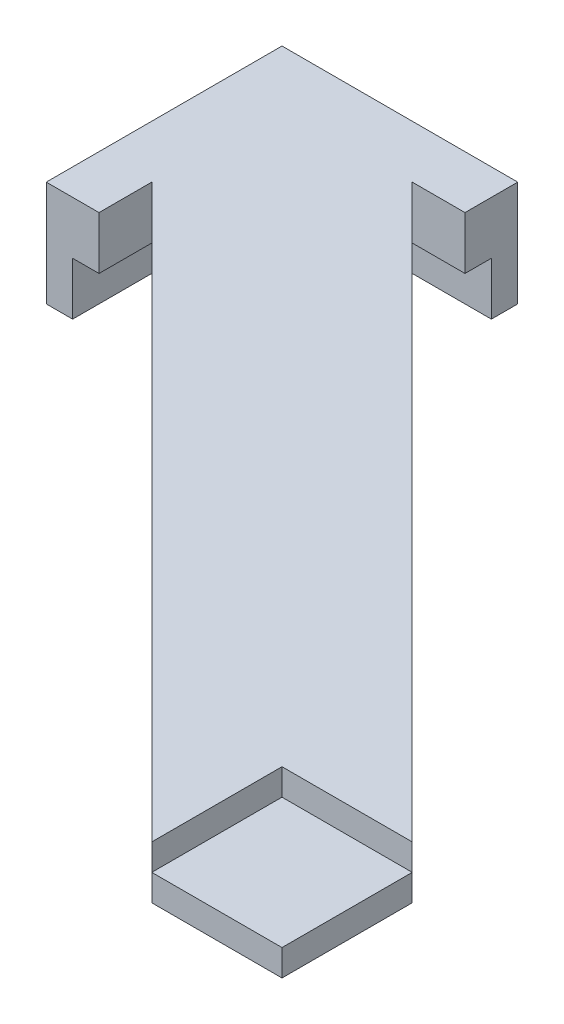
ISO-10303-21;
HEADER;
FILE_DESCRIPTION(('STEP AP214'),'2;1');
FILE_NAME('part.step','',(''),(''),'','','');
FILE_SCHEMA(('AUTOMOTIVE_DESIGN { 1 0 10303 214 1 1 1 1 }'));
ENDSEC;
DATA;
#1=APPLICATION_CONTEXT('core data for automotive mechanical design processes');
#2=APPLICATION_PROTOCOL_DEFINITION('international standard','automotive_design',2000,#1);
#3=PRODUCT_CONTEXT('',#1,'mechanical');
#4=PRODUCT('Part','Part','',(#3));
#5=PRODUCT_RELATED_PRODUCT_CATEGORY('part','',(#4));
#6=PRODUCT_DEFINITION_FORMATION('','',#4);
#7=PRODUCT_DEFINITION_CONTEXT('part definition',#1,'design');
#8=PRODUCT_DEFINITION('design','',#6,#7);
#9=PRODUCT_DEFINITION_SHAPE('','',#8);
#10=(LENGTH_UNIT() NAMED_UNIT(*) SI_UNIT(.MILLI.,.METRE.));
#11=(NAMED_UNIT(*) PLANE_ANGLE_UNIT() SI_UNIT($,.RADIAN.));
#12=(NAMED_UNIT(*) SI_UNIT($,.STERADIAN.) SOLID_ANGLE_UNIT());
#13=UNCERTAINTY_MEASURE_WITH_UNIT(LENGTH_MEASURE(1.E-05),#10,'distance_accuracy_value','');
#14=(GEOMETRIC_REPRESENTATION_CONTEXT(3) GLOBAL_UNCERTAINTY_ASSIGNED_CONTEXT((#13)) GLOBAL_UNIT_ASSIGNED_CONTEXT((#10,
#11,#12)) REPRESENTATION_CONTEXT('',''));
#15=CARTESIAN_POINT('',(0.,0.,0.));
#16=DIRECTION('',(0.,0.,1.));
#17=DIRECTION('',(1.,0.,0.));
#18=AXIS2_PLACEMENT_3D('',#15,#16,#17);
#19=CARTESIAN_POINT('',(0.,0.,0.));
#20=DIRECTION('',(0.,1.,0.));
#21=DIRECTION('',(0.,0.,1.));
#22=AXIS2_PLACEMENT_3D('',#19,#20,#21);
#23=PLANE('',#22);
#24=DIRECTION('',(0.,0.,1.));
#25=VECTOR('',#24,1.);
#26=CARTESIAN_POINT('',(0.,0.,-49.1568651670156));
#27=LINE('',#26,#25);
#28=CARTESIAN_POINT('',(0.,0.,-69.));
#29=VERTEX_POINT('',#28);
#30=CARTESIAN_POINT('',(0.,0.,-49.1568651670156));
#31=VERTEX_POINT('',#30);
#32=EDGE_CURVE('E182',#29,#31,#27,.T.);
#33=ORIENTED_EDGE('',*,*,#32,.F.);
#34=DIRECTION('',(-1.,0.,0.));
#35=VECTOR('',#34,1.);
#36=CARTESIAN_POINT('',(19.8431348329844,0.,-69.));
#37=LINE('',#36,#35);
#38=CARTESIAN_POINT('',(19.8431348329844,0.,-69.));
#39=VERTEX_POINT('',#38);
#40=EDGE_CURVE('E61',#39,#29,#37,.T.);
#41=ORIENTED_EDGE('',*,*,#40,.F.);
#42=DIRECTION('',(0.,0.,-1.));
#43=VECTOR('',#42,1.);
#44=CARTESIAN_POINT('',(19.8431348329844,0.,-71.5));
#45=LINE('',#44,#43);
#46=CARTESIAN_POINT('',(19.8431348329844,0.,-66.5));
#47=VERTEX_POINT('',#46);
#48=EDGE_CURVE('E274',#47,#39,#45,.T.);
#49=ORIENTED_EDGE('',*,*,#48,.F.);
#50=DIRECTION('',(1.,0.,0.));
#51=VECTOR('',#50,1.);
#52=CARTESIAN_POINT('',(19.8431348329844,0.,-66.5));
#53=LINE('',#52,#51);
#54=CARTESIAN_POINT('',(14.8431348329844,0.,-66.5));
#55=VERTEX_POINT('',#54);
#56=EDGE_CURVE('E271',#55,#47,#53,.T.);
#57=ORIENTED_EDGE('',*,*,#56,.F.);
#58=DIRECTION('',(-0.707106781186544,0.,-0.707106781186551));
#59=VECTOR('',#58,1.);
#60=CARTESIAN_POINT('',(14.8431348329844,0.,-66.5));
#61=LINE('',#60,#59);
#62=CARTESIAN_POINT('',(69.,0.,-12.3431348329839));
#63=VERTEX_POINT('',#62);
#64=EDGE_CURVE('E268',#63,#55,#61,.T.);
#65=ORIENTED_EDGE('',*,*,#64,.F.);
#66=DIRECTION('',(0.,0.,-1.));
#67=VECTOR('',#66,1.);
#68=CARTESIAN_POINT('',(69.,0.,-12.3431348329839));
#69=LINE('',#68,#67);
#70=CARTESIAN_POINT('',(69.,0.,0.));
#71=VERTEX_POINT('',#70);
#72=EDGE_CURVE('E264',#71,#63,#69,.T.);
#73=ORIENTED_EDGE('',*,*,#72,.F.);
#74=DIRECTION('',(1.,0.,0.));
#75=VECTOR('',#74,1.);
#76=CARTESIAN_POINT('',(69.,0.,0.));
#77=LINE('',#76,#75);
#78=CARTESIAN_POINT('',(56.656865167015,0.,0.));
#79=VERTEX_POINT('',#78);
#80=EDGE_CURVE('E234',#79,#71,#77,.T.);
#81=ORIENTED_EDGE('',*,*,#80,.F.);
#82=DIRECTION('',(0.707106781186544,0.,0.707106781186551));
#83=VECTOR('',#82,1.);
#84=CARTESIAN_POINT('',(56.656865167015,0.,0.));
#85=LINE('',#84,#83);
#86=CARTESIAN_POINT('',(2.5,0.,-54.1568651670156));
#87=VERTEX_POINT('',#86);
#88=EDGE_CURVE('E239',#87,#79,#85,.T.);
#89=ORIENTED_EDGE('',*,*,#88,.F.);
#90=DIRECTION('',(0.,0.,-1.));
#91=VECTOR('',#90,1.);
#92=CARTESIAN_POINT('',(2.5,0.,-54.1568651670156));
#93=LINE('',#92,#91);
#94=CARTESIAN_POINT('',(2.5,0.,-49.1568651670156));
#95=VERTEX_POINT('',#94);
#96=EDGE_CURVE('E279',#95,#87,#93,.T.);
#97=ORIENTED_EDGE('',*,*,#96,.F.);
#98=DIRECTION('',(1.,0.,0.));
#99=VECTOR('',#98,1.);
#100=CARTESIAN_POINT('',(2.5,0.,-49.1568651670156));
#101=LINE('',#100,#99);
#102=EDGE_CURVE('E67',#31,#95,#101,.T.);
#103=ORIENTED_EDGE('',*,*,#102,.F.);
#104=EDGE_LOOP('',(#33,#41,#49,#57,#65,#73,#81,#89,#97,#103));
#105=FACE_BOUND('',#104,.T.);
#106=ADVANCED_FACE('F45',(#105),#23,.F.);
#107=CARTESIAN_POINT('',(69.,5.,0.));
#108=DIRECTION('',(0.,0.,-1.));
#109=DIRECTION('',(-1.,0.,0.));
#110=AXIS2_PLACEMENT_3D('',#107,#108,#109);
#111=PLANE('',#110);
#112=DIRECTION('',(1.,0.,0.));
#113=VECTOR('',#112,1.);
#114=CARTESIAN_POINT('',(56.656865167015,2.5,0.));
#115=LINE('',#114,#113);
#116=CARTESIAN_POINT('',(56.656865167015,2.5,0.));
#117=VERTEX_POINT('',#116);
#118=CARTESIAN_POINT('',(69.,2.5,0.));
#119=VERTEX_POINT('',#118);
#120=EDGE_CURVE('E210',#117,#119,#115,.T.);
#121=ORIENTED_EDGE('',*,*,#120,.F.);
#122=DIRECTION('',(0.,-1.,0.));
#123=VECTOR('',#122,1.);
#124=CARTESIAN_POINT('',(56.656865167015,5.,0.));
#125=LINE('',#124,#123);
#126=EDGE_CURVE('E260',#117,#79,#125,.T.);
#127=ORIENTED_EDGE('',*,*,#126,.T.);
#128=ORIENTED_EDGE('',*,*,#80,.T.);
#129=DIRECTION('',(0.,-1.,0.));
#130=VECTOR('',#129,1.);
#131=CARTESIAN_POINT('',(69.,5.,0.));
#132=LINE('',#131,#130);
#133=EDGE_CURVE('E11',#119,#71,#132,.T.);
#134=ORIENTED_EDGE('',*,*,#133,.F.);
#135=EDGE_LOOP('',(#121,#127,#128,#134));
#136=FACE_BOUND('',#135,.T.);
#137=ADVANCED_FACE('F47',(#136),#111,.F.);
#138=CARTESIAN_POINT('',(69.,5.,-12.3431348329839));
#139=DIRECTION('',(-1.,0.,0.));
#140=DIRECTION('',(0.,0.,1.));
#141=AXIS2_PLACEMENT_3D('',#138,#139,#140);
#142=PLANE('',#141);
#143=DIRECTION('',(0.,0.,-1.));
#144=VECTOR('',#143,1.);
#145=CARTESIAN_POINT('',(69.,2.5,0.));
#146=LINE('',#145,#144);
#147=CARTESIAN_POINT('',(69.,2.5,-12.3431348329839));
#148=VERTEX_POINT('',#147);
#149=EDGE_CURVE('E213',#119,#148,#146,.T.);
#150=ORIENTED_EDGE('',*,*,#149,.F.);
#151=ORIENTED_EDGE('',*,*,#133,.T.);
#152=ORIENTED_EDGE('',*,*,#72,.T.);
#153=DIRECTION('',(0.,-1.,0.));
#154=VECTOR('',#153,1.);
#155=CARTESIAN_POINT('',(69.,5.,-12.3431348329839));
#156=LINE('',#155,#154);
#157=EDGE_CURVE('E307',#148,#63,#156,.T.);
#158=ORIENTED_EDGE('',*,*,#157,.F.);
#159=EDGE_LOOP('',(#150,#151,#152,#158));
#160=FACE_BOUND('',#159,.T.);
#161=ADVANCED_FACE('F320',(#160),#142,.F.);
#162=CARTESIAN_POINT('',(14.8431348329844,5.,-66.5));
#163=DIRECTION('',(-0.707106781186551,0.,0.707106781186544));
#164=DIRECTION('',(0.707106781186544,0.,0.707106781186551));
#165=AXIS2_PLACEMENT_3D('',#162,#163,#164);
#166=PLANE('',#165);
#167=ORIENTED_EDGE('',*,*,#64,.T.);
#168=DIRECTION('',(0.,-1.,0.));
#169=VECTOR('',#168,1.);
#170=CARTESIAN_POINT('',(14.8431348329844,5.,-66.5));
#171=LINE('',#170,#169);
#172=CARTESIAN_POINT('',(14.8431348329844,5.,-66.5));
#173=VERTEX_POINT('',#172);
#174=EDGE_CURVE('E304',#173,#55,#171,.T.);
#175=ORIENTED_EDGE('',*,*,#174,.F.);
#176=DIRECTION('',(-0.707106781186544,0.,-0.707106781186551));
#177=VECTOR('',#176,1.);
#178=CARTESIAN_POINT('',(14.8431348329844,5.,-66.5));
#179=LINE('',#178,#177);
#180=CARTESIAN_POINT('',(69.,5.,-12.3431348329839));
#181=VERTEX_POINT('',#180);
#182=EDGE_CURVE('E235',#181,#173,#179,.T.);
#183=ORIENTED_EDGE('',*,*,#182,.F.);
#184=EDGE_CURVE('E54',#181,#148,#156,.T.);
#185=ORIENTED_EDGE('',*,*,#184,.T.);
#186=ORIENTED_EDGE('',*,*,#157,.T.);
#187=EDGE_LOOP('',(#167,#175,#183,#185,#186));
#188=FACE_BOUND('',#187,.T.);
#189=ADVANCED_FACE('F314',(#188),#166,.F.);
#190=CARTESIAN_POINT('',(19.8431348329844,5.,-66.5));
#191=DIRECTION('',(0.,0.,-1.));
#192=DIRECTION('',(-1.,0.,0.));
#193=AXIS2_PLACEMENT_3D('',#190,#191,#192);
#194=PLANE('',#193);
#195=ORIENTED_EDGE('',*,*,#56,.T.);
#196=DIRECTION('',(0.,-1.,0.));
#197=VECTOR('',#196,1.);
#198=CARTESIAN_POINT('',(19.8431348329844,5.,-66.5));
#199=LINE('',#198,#197);
#200=CARTESIAN_POINT('',(19.8431348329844,5.,-66.5));
#201=VERTEX_POINT('',#200);
#202=EDGE_CURVE('E163',#201,#47,#199,.T.);
#203=ORIENTED_EDGE('',*,*,#202,.F.);
#204=DIRECTION('',(1.,0.,0.));
#205=VECTOR('',#204,1.);
#206=CARTESIAN_POINT('',(19.8431348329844,5.,-66.5));
#207=LINE('',#206,#205);
#208=EDGE_CURVE('E238',#173,#201,#207,.T.);
#209=ORIENTED_EDGE('',*,*,#208,.F.);
#210=ORIENTED_EDGE('',*,*,#174,.T.);
#211=EDGE_LOOP('',(#195,#203,#209,#210));
#212=FACE_BOUND('',#211,.T.);
#213=ADVANCED_FACE('F326',(#212),#194,.F.);
#214=CARTESIAN_POINT('',(19.8431348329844,5.,-71.5));
#215=DIRECTION('',(-1.,0.,0.));
#216=DIRECTION('',(0.,0.,1.));
#217=AXIS2_PLACEMENT_3D('',#214,#215,#216);
#218=PLANE('',#217);
#219=ORIENTED_EDGE('',*,*,#48,.T.);
#220=DIRECTION('',(0.,1.,0.));
#221=VECTOR('',#220,1.);
#222=CARTESIAN_POINT('',(19.8431348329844,-5.,-69.));
#223=LINE('',#222,#221);
#224=CARTESIAN_POINT('',(19.8431348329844,-5.,-69.));
#225=VERTEX_POINT('',#224);
#226=EDGE_CURVE('E170',#225,#39,#223,.T.);
#227=ORIENTED_EDGE('',*,*,#226,.F.);
#228=DIRECTION('',(0.,0.,1.));
#229=VECTOR('',#228,1.);
#230=CARTESIAN_POINT('',(19.8431348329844,-5.,-69.));
#231=LINE('',#230,#229);
#232=CARTESIAN_POINT('',(19.8431348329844,-5.,-71.5));
#233=VERTEX_POINT('',#232);
#234=EDGE_CURVE('E167',#233,#225,#231,.T.);
#235=ORIENTED_EDGE('',*,*,#234,.F.);
#236=DIRECTION('',(0.,-1.,0.));
#237=VECTOR('',#236,1.);
#238=CARTESIAN_POINT('',(19.8431348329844,5.,-71.5));
#239=LINE('',#238,#237);
#240=CARTESIAN_POINT('',(19.8431348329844,5.,-71.5));
#241=VERTEX_POINT('',#240);
#242=EDGE_CURVE('E153',#241,#233,#239,.T.);
#243=ORIENTED_EDGE('',*,*,#242,.F.);
#244=DIRECTION('',(0.,0.,-1.));
#245=VECTOR('',#244,1.);
#246=CARTESIAN_POINT('',(19.8431348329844,5.,-71.5));
#247=LINE('',#246,#245);
#248=EDGE_CURVE('E242',#201,#241,#247,.T.);
#249=ORIENTED_EDGE('',*,*,#248,.F.);
#250=ORIENTED_EDGE('',*,*,#202,.T.);
#251=EDGE_LOOP('',(#219,#227,#235,#243,#249,#250));
#252=FACE_BOUND('',#251,.T.);
#253=ADVANCED_FACE('F168',(#252),#218,.F.);
#254=CARTESIAN_POINT('',(-2.5,5.,-71.5));
#255=DIRECTION('',(0.,0.,1.));
#256=DIRECTION('',(1.,0.,0.));
#257=AXIS2_PLACEMENT_3D('',#254,#255,#256);
#258=PLANE('',#257);
#259=ORIENTED_EDGE('',*,*,#242,.T.);
#260=DIRECTION('',(1.,0.,0.));
#261=VECTOR('',#260,1.);
#262=CARTESIAN_POINT('',(19.8431348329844,-5.,-71.5));
#263=LINE('',#262,#261);
#264=CARTESIAN_POINT('',(-2.5,-5.,-71.5));
#265=VERTEX_POINT('',#264);
#266=EDGE_CURVE('E158',#265,#233,#263,.T.);
#267=ORIENTED_EDGE('',*,*,#266,.F.);
#268=DIRECTION('',(0.,-1.,0.));
#269=VECTOR('',#268,1.);
#270=CARTESIAN_POINT('',(-2.5,5.,-71.5));
#271=LINE('',#270,#269);
#272=CARTESIAN_POINT('',(-2.5,5.,-71.5));
#273=VERTEX_POINT('',#272);
#274=EDGE_CURVE('E164',#273,#265,#271,.T.);
#275=ORIENTED_EDGE('',*,*,#274,.F.);
#276=DIRECTION('',(-1.,0.,0.));
#277=VECTOR('',#276,1.);
#278=CARTESIAN_POINT('',(-2.5,5.,-71.5));
#279=LINE('',#278,#277);
#280=EDGE_CURVE('E159',#241,#273,#279,.T.);
#281=ORIENTED_EDGE('',*,*,#280,.F.);
#282=EDGE_LOOP('',(#259,#267,#275,#281));
#283=FACE_BOUND('',#282,.T.);
#284=ADVANCED_FACE('F155',(#283),#258,.F.);
#285=CARTESIAN_POINT('',(-2.5,5.,-49.1568651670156));
#286=DIRECTION('',(1.,0.,0.));
#287=DIRECTION('',(0.,0.,-1.));
#288=AXIS2_PLACEMENT_3D('',#285,#286,#287);
#289=PLANE('',#288);
#290=ORIENTED_EDGE('',*,*,#274,.T.);
#291=DIRECTION('',(0.,0.,-1.));
#292=VECTOR('',#291,1.);
#293=CARTESIAN_POINT('',(-2.5,-5.,-71.5));
#294=LINE('',#293,#292);
#295=CARTESIAN_POINT('',(-2.5,-5.,-49.1568651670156));
#296=VERTEX_POINT('',#295);
#297=EDGE_CURVE('E180',#296,#265,#294,.T.);
#298=ORIENTED_EDGE('',*,*,#297,.F.);
#299=DIRECTION('',(0.,-1.,0.));
#300=VECTOR('',#299,1.);
#301=CARTESIAN_POINT('',(-2.5,5.,-49.1568651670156));
#302=LINE('',#301,#300);
#303=CARTESIAN_POINT('',(-2.5,5.,-49.1568651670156));
#304=VERTEX_POINT('',#303);
#305=EDGE_CURVE('E296',#304,#296,#302,.T.);
#306=ORIENTED_EDGE('',*,*,#305,.F.);
#307=DIRECTION('',(0.,0.,1.));
#308=VECTOR('',#307,1.);
#309=CARTESIAN_POINT('',(-2.5,5.,-49.1568651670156));
#310=LINE('',#309,#308);
#311=EDGE_CURVE('E247',#273,#304,#310,.T.);
#312=ORIENTED_EDGE('',*,*,#311,.F.);
#313=EDGE_LOOP('',(#290,#298,#306,#312));
#314=FACE_BOUND('',#313,.T.);
#315=ADVANCED_FACE('F363',(#314),#289,.F.);
#316=CARTESIAN_POINT('',(2.5,5.,-49.1568651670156));
#317=DIRECTION('',(0.,0.,-1.));
#318=DIRECTION('',(-1.,0.,0.));
#319=AXIS2_PLACEMENT_3D('',#316,#317,#318);
#320=PLANE('',#319);
#321=ORIENTED_EDGE('',*,*,#305,.T.);
#322=DIRECTION('',(-1.,0.,0.));
#323=VECTOR('',#322,1.);
#324=CARTESIAN_POINT('',(-2.5,-5.,-49.1568651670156));
#325=LINE('',#324,#323);
#326=CARTESIAN_POINT('',(0.,-5.,-49.1568651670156));
#327=VERTEX_POINT('',#326);
#328=EDGE_CURVE('E192',#327,#296,#325,.T.);
#329=ORIENTED_EDGE('',*,*,#328,.F.);
#330=DIRECTION('',(0.,1.,0.));
#331=VECTOR('',#330,1.);
#332=CARTESIAN_POINT('',(0.,-5.,-49.1568651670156));
#333=LINE('',#332,#331);
#334=EDGE_CURVE('E197',#327,#31,#333,.T.);
#335=ORIENTED_EDGE('',*,*,#334,.T.);
#336=ORIENTED_EDGE('',*,*,#102,.T.);
#337=DIRECTION('',(0.,-1.,0.));
#338=VECTOR('',#337,1.);
#339=CARTESIAN_POINT('',(2.5,5.,-49.1568651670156));
#340=LINE('',#339,#338);
#341=CARTESIAN_POINT('',(2.5,5.,-49.1568651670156));
#342=VERTEX_POINT('',#341);
#343=EDGE_CURVE('E292',#342,#95,#340,.T.);
#344=ORIENTED_EDGE('',*,*,#343,.F.);
#345=DIRECTION('',(1.,0.,0.));
#346=VECTOR('',#345,1.);
#347=CARTESIAN_POINT('',(2.5,5.,-49.1568651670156));
#348=LINE('',#347,#346);
#349=EDGE_CURVE('E250',#304,#342,#348,.T.);
#350=ORIENTED_EDGE('',*,*,#349,.F.);
#351=EDGE_LOOP('',(#321,#329,#335,#336,#344,#350));
#352=FACE_BOUND('',#351,.T.);
#353=ADVANCED_FACE('F352',(#352),#320,.F.);
#354=CARTESIAN_POINT('',(2.5,5.,-54.1568651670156));
#355=DIRECTION('',(-1.,0.,0.));
#356=DIRECTION('',(0.,0.,1.));
#357=AXIS2_PLACEMENT_3D('',#354,#355,#356);
#358=PLANE('',#357);
#359=ORIENTED_EDGE('',*,*,#96,.T.);
#360=DIRECTION('',(0.,-1.,0.));
#361=VECTOR('',#360,1.);
#362=CARTESIAN_POINT('',(2.5,5.,-54.1568651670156));
#363=LINE('',#362,#361);
#364=CARTESIAN_POINT('',(2.5,5.,-54.1568651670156));
#365=VERTEX_POINT('',#364);
#366=EDGE_CURVE('E288',#365,#87,#363,.T.);
#367=ORIENTED_EDGE('',*,*,#366,.F.);
#368=DIRECTION('',(0.,0.,-1.));
#369=VECTOR('',#368,1.);
#370=CARTESIAN_POINT('',(2.5,5.,-54.1568651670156));
#371=LINE('',#370,#369);
#372=EDGE_CURVE('E253',#342,#365,#371,.T.);
#373=ORIENTED_EDGE('',*,*,#372,.F.);
#374=ORIENTED_EDGE('',*,*,#343,.T.);
#375=EDGE_LOOP('',(#359,#367,#373,#374));
#376=FACE_BOUND('',#375,.T.);
#377=ADVANCED_FACE('F348',(#376),#358,.F.);
#378=CARTESIAN_POINT('',(56.656865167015,5.,0.));
#379=DIRECTION('',(0.707106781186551,0.,-0.707106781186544));
#380=DIRECTION('',(-0.707106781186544,0.,-0.707106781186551));
#381=AXIS2_PLACEMENT_3D('',#378,#379,#380);
#382=PLANE('',#381);
#383=ORIENTED_EDGE('',*,*,#88,.T.);
#384=ORIENTED_EDGE('',*,*,#126,.F.);
#385=CARTESIAN_POINT('',(56.656865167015,5.,0.));
#386=VERTEX_POINT('',#385);
#387=EDGE_CURVE('E285',#386,#117,#125,.T.);
#388=ORIENTED_EDGE('',*,*,#387,.F.);
#389=DIRECTION('',(0.707106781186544,0.,0.707106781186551));
#390=VECTOR('',#389,1.);
#391=CARTESIAN_POINT('',(56.656865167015,5.,0.));
#392=LINE('',#391,#390);
#393=EDGE_CURVE('E256',#365,#386,#392,.T.);
#394=ORIENTED_EDGE('',*,*,#393,.F.);
#395=ORIENTED_EDGE('',*,*,#366,.T.);
#396=EDGE_LOOP('',(#383,#384,#388,#394,#395));
#397=FACE_BOUND('',#396,.T.);
#398=ADVANCED_FACE('F342',(#397),#382,.F.);
#399=CARTESIAN_POINT('',(0.,5.,0.));
#400=DIRECTION('',(0.,1.,0.));
#401=DIRECTION('',(0.,0.,1.));
#402=AXIS2_PLACEMENT_3D('',#399,#400,#401);
#403=PLANE('',#402);
#404=DIRECTION('',(0.,0.,1.));
#405=VECTOR('',#404,1.);
#406=CARTESIAN_POINT('',(56.656865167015,5.,0.));
#407=LINE('',#406,#405);
#408=CARTESIAN_POINT('',(56.656865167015,5.,-12.3431348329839));
#409=VERTEX_POINT('',#408);
#410=EDGE_CURVE('E214',#409,#386,#407,.T.);
#411=ORIENTED_EDGE('',*,*,#410,.F.);
#412=DIRECTION('',(-1.,0.,0.));
#413=VECTOR('',#412,1.);
#414=CARTESIAN_POINT('',(56.656865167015,5.,-12.3431348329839));
#415=LINE('',#414,#413);
#416=EDGE_CURVE('E209',#181,#409,#415,.T.);
#417=ORIENTED_EDGE('',*,*,#416,.F.);
#418=ORIENTED_EDGE('',*,*,#182,.T.);
#419=ORIENTED_EDGE('',*,*,#208,.T.);
#420=ORIENTED_EDGE('',*,*,#248,.T.);
#421=ORIENTED_EDGE('',*,*,#280,.T.);
#422=ORIENTED_EDGE('',*,*,#311,.T.);
#423=ORIENTED_EDGE('',*,*,#349,.T.);
#424=ORIENTED_EDGE('',*,*,#372,.T.);
#425=ORIENTED_EDGE('',*,*,#393,.T.);
#426=EDGE_LOOP('',(#411,#417,#418,#419,#420,#421,#422,#423,#424,#425));
#427=FACE_BOUND('',#426,.T.);
#428=ADVANCED_FACE('F330',(#427),#403,.T.);
#429=CARTESIAN_POINT('',(56.656865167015,2.5,0.));
#430=DIRECTION('',(-1.,0.,0.));
#431=DIRECTION('',(0.,0.,1.));
#432=AXIS2_PLACEMENT_3D('',#429,#430,#431);
#433=PLANE('',#432);
#434=ORIENTED_EDGE('',*,*,#410,.T.);
#435=ORIENTED_EDGE('',*,*,#387,.T.);
#436=DIRECTION('',(0.,0.,1.));
#437=VECTOR('',#436,1.);
#438=CARTESIAN_POINT('',(56.656865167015,2.5,0.));
#439=LINE('',#438,#437);
#440=CARTESIAN_POINT('',(56.656865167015,2.5,-12.3431348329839));
#441=VERTEX_POINT('',#440);
#442=EDGE_CURVE('E222',#441,#117,#439,.T.);
#443=ORIENTED_EDGE('',*,*,#442,.F.);
#444=DIRECTION('',(0.,1.,0.));
#445=VECTOR('',#444,1.);
#446=CARTESIAN_POINT('',(56.656865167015,2.5,-12.3431348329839));
#447=LINE('',#446,#445);
#448=EDGE_CURVE('E226',#441,#409,#447,.T.);
#449=ORIENTED_EDGE('',*,*,#448,.T.);
#450=EDGE_LOOP('',(#434,#435,#443,#449));
#451=FACE_BOUND('',#450,.T.);
#452=ADVANCED_FACE('F366',(#451),#433,.F.);
#453=CARTESIAN_POINT('',(56.656865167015,2.5,-12.3431348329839));
#454=DIRECTION('',(0.,0.,-1.));
#455=DIRECTION('',(-1.,0.,0.));
#456=AXIS2_PLACEMENT_3D('',#453,#454,#455);
#457=PLANE('',#456);
#458=ORIENTED_EDGE('',*,*,#416,.T.);
#459=ORIENTED_EDGE('',*,*,#448,.F.);
#460=DIRECTION('',(-1.,0.,0.));
#461=VECTOR('',#460,1.);
#462=CARTESIAN_POINT('',(56.656865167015,2.5,-12.3431348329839));
#463=LINE('',#462,#461);
#464=EDGE_CURVE('E218',#148,#441,#463,.T.);
#465=ORIENTED_EDGE('',*,*,#464,.F.);
#466=ORIENTED_EDGE('',*,*,#184,.F.);
#467=EDGE_LOOP('',(#458,#459,#465,#466));
#468=FACE_BOUND('',#467,.T.);
#469=ADVANCED_FACE('F333',(#468),#457,.F.);
#470=CARTESIAN_POINT('',(0.,2.5,0.));
#471=DIRECTION('',(0.,1.,0.));
#472=DIRECTION('',(0.,0.,1.));
#473=AXIS2_PLACEMENT_3D('',#470,#471,#472);
#474=PLANE('',#473);
#475=ORIENTED_EDGE('',*,*,#120,.T.);
#476=ORIENTED_EDGE('',*,*,#149,.T.);
#477=ORIENTED_EDGE('',*,*,#464,.T.);
#478=ORIENTED_EDGE('',*,*,#442,.T.);
#479=EDGE_LOOP('',(#475,#476,#477,#478));
#480=FACE_BOUND('',#479,.T.);
#481=ADVANCED_FACE('F336',(#480),#474,.T.);
#482=CARTESIAN_POINT('',(19.8431348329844,-5.,-69.));
#483=DIRECTION('',(0.,0.,-1.));
#484=DIRECTION('',(-1.,0.,0.));
#485=AXIS2_PLACEMENT_3D('',#482,#483,#484);
#486=PLANE('',#485);
#487=ORIENTED_EDGE('',*,*,#40,.T.);
#488=DIRECTION('',(0.,1.,0.));
#489=VECTOR('',#488,1.);
#490=CARTESIAN_POINT('',(0.,-5.,-69.));
#491=LINE('',#490,#489);
#492=CARTESIAN_POINT('',(0.,-5.,-69.));
#493=VERTEX_POINT('',#492);
#494=EDGE_CURVE('E203',#493,#29,#491,.T.);
#495=ORIENTED_EDGE('',*,*,#494,.F.);
#496=DIRECTION('',(-1.,0.,0.));
#497=VECTOR('',#496,1.);
#498=CARTESIAN_POINT('',(19.8431348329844,-5.,-69.));
#499=LINE('',#498,#497);
#500=EDGE_CURVE('E174',#225,#493,#499,.T.);
#501=ORIENTED_EDGE('',*,*,#500,.F.);
#502=ORIENTED_EDGE('',*,*,#226,.T.);
#503=EDGE_LOOP('',(#487,#495,#501,#502));
#504=FACE_BOUND('',#503,.T.);
#505=ADVANCED_FACE('F360',(#504),#486,.F.);
#506=CARTESIAN_POINT('',(0.,-5.,-49.1568651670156));
#507=DIRECTION('',(-1.,0.,0.));
#508=DIRECTION('',(0.,0.,1.));
#509=AXIS2_PLACEMENT_3D('',#506,#507,#508);
#510=PLANE('',#509);
#511=ORIENTED_EDGE('',*,*,#32,.T.);
#512=ORIENTED_EDGE('',*,*,#334,.F.);
#513=DIRECTION('',(0.,0.,1.));
#514=VECTOR('',#513,1.);
#515=CARTESIAN_POINT('',(0.,-5.,-49.1568651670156));
#516=LINE('',#515,#514);
#517=EDGE_CURVE('E189',#493,#327,#516,.T.);
#518=ORIENTED_EDGE('',*,*,#517,.F.);
#519=ORIENTED_EDGE('',*,*,#494,.T.);
#520=EDGE_LOOP('',(#511,#512,#518,#519));
#521=FACE_BOUND('',#520,.T.);
#522=ADVANCED_FACE('F357',(#521),#510,.F.);
#523=CARTESIAN_POINT('',(0.,-5.,0.));
#524=DIRECTION('',(0.,1.,0.));
#525=DIRECTION('',(0.,0.,1.));
#526=AXIS2_PLACEMENT_3D('',#523,#524,#525);
#527=PLANE('',#526);
#528=ORIENTED_EDGE('',*,*,#266,.T.);
#529=ORIENTED_EDGE('',*,*,#234,.T.);
#530=ORIENTED_EDGE('',*,*,#500,.T.);
#531=ORIENTED_EDGE('',*,*,#517,.T.);
#532=ORIENTED_EDGE('',*,*,#328,.T.);
#533=ORIENTED_EDGE('',*,*,#297,.T.);
#534=EDGE_LOOP('',(#528,#529,#530,#531,#532,#533));
#535=FACE_BOUND('',#534,.T.);
#536=ADVANCED_FACE('F177',(#535),#527,.F.);
#537=CLOSED_SHELL('',(#106,#137,#161,#189,#213,#253,#284,#315,#353,#377,#398,#428,#452,#469,
#481,#505,#522,#536));
#538=MANIFOLD_SOLID_BREP('B2',#537);
#539=ADVANCED_BREP_SHAPE_REPRESENTATION('',(#18,#538),#14);
#540=SHAPE_DEFINITION_REPRESENTATION(#9,#539);
ENDSEC;
END-ISO-10303-21;
